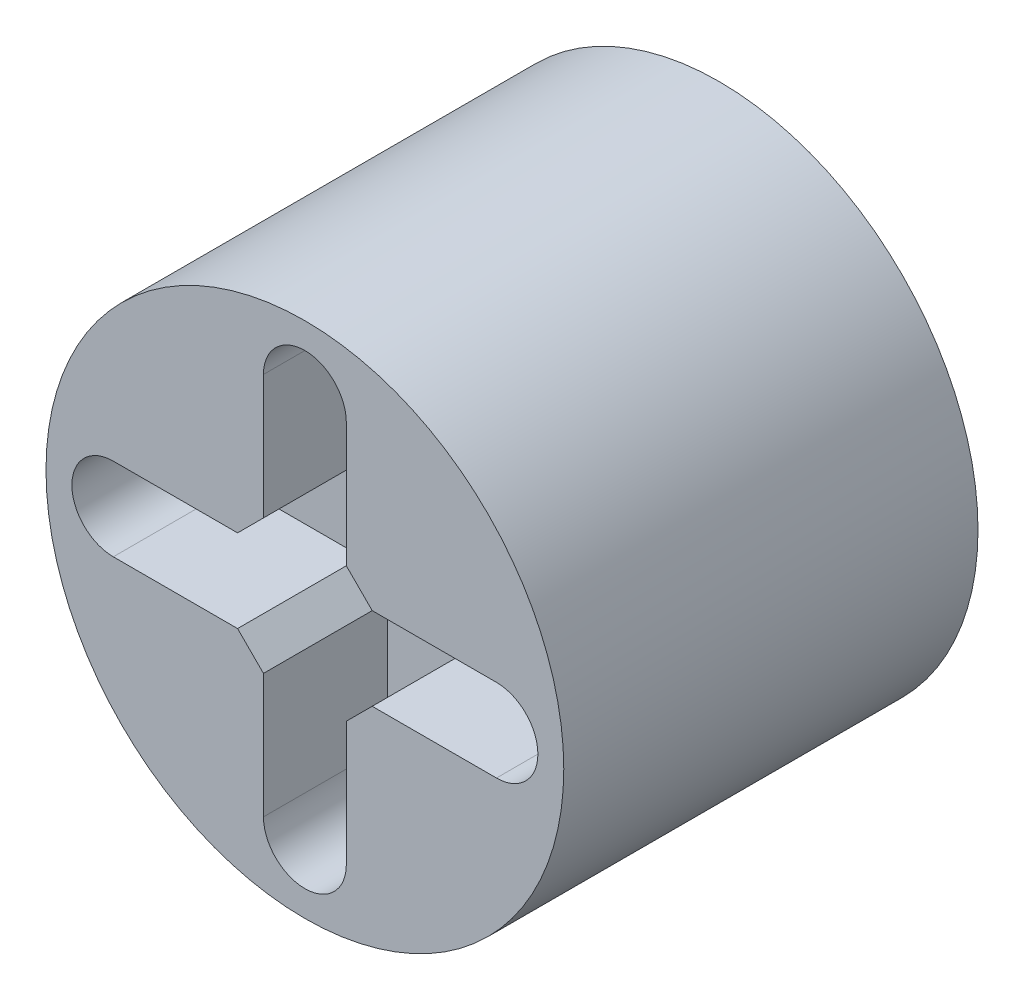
from build123d import *

# Parameters (mm, degrees)
SKETCH1_R           = 12.5
SKETCH1_W           = 10
SKETCH1_H           = 10
BOSS_EXTRUDE1_DEPTH = 10
SKETCH2_R           = 12.5
BOSS_EXTRUDE2_DEPTH = 10
CUT_EXTRUDE2_DEPTH  = 6
CHAMFER1_SIZE       = 1.25


with BuildPart() as part:
    # Sketch1 → Boss-Extrude1 (new body)
    with BuildSketch(Plane.XY):
        Circle(SKETCH1_R)
        Rectangle(SKETCH1_W, SKETCH1_H, mode=Mode.SUBTRACT)
    extrude(amount=BOSS_EXTRUDE1_DEPTH)

    # Sketch2 → Boss-Extrude2 (add)
    with BuildSketch(Plane.XY.offset(10)):
        Circle(SKETCH2_R)
    extrude(amount=BOSS_EXTRUDE2_DEPTH)

    # Sketch5 → Cut-Extrude2 (cut)
    with BuildSketch(Plane.XY.offset(20)):
        with BuildLine():
            Line((-9.25, 2), (-2, 2))
            Line((-2, 2), (-2, 9.25))
            ThreePointArc((-2, 9.25), (0, 11.25), (2, 9.25))
            Line((2, 9.25), (2, 2))
            Line((2, 2), (9.25, 2))
            ThreePointArc((9.25, 2), (11.25, 0), (9.25, -2))
            Line((9.25, -2), (2, -2))
            Line((2, -2), (2, -9.25))
            ThreePointArc((2, -9.25), (0, -11.25), (-2, -9.25))
            Line((-2, -9.25), (-2, -2))
            Line((-2, -2), (-9.25, -2))
            ThreePointArc((-9.25, -2), (-11.25, 0), (-9.25, 2))
        make_face()
    extrude(amount=-CUT_EXTRUDE2_DEPTH, mode=Mode.SUBTRACT)

    # Chamfer1
    chamfer1_edges = [part.edges().sort_by_distance(p)[0] for p in [
        (2, -2, 17),
        (-2, -2, 17),
        (-2, 2, 17),
        (2, 2, 17),
    ]]
    chamfer(chamfer1_edges, length=CHAMFER1_SIZE)


solid = part.part
